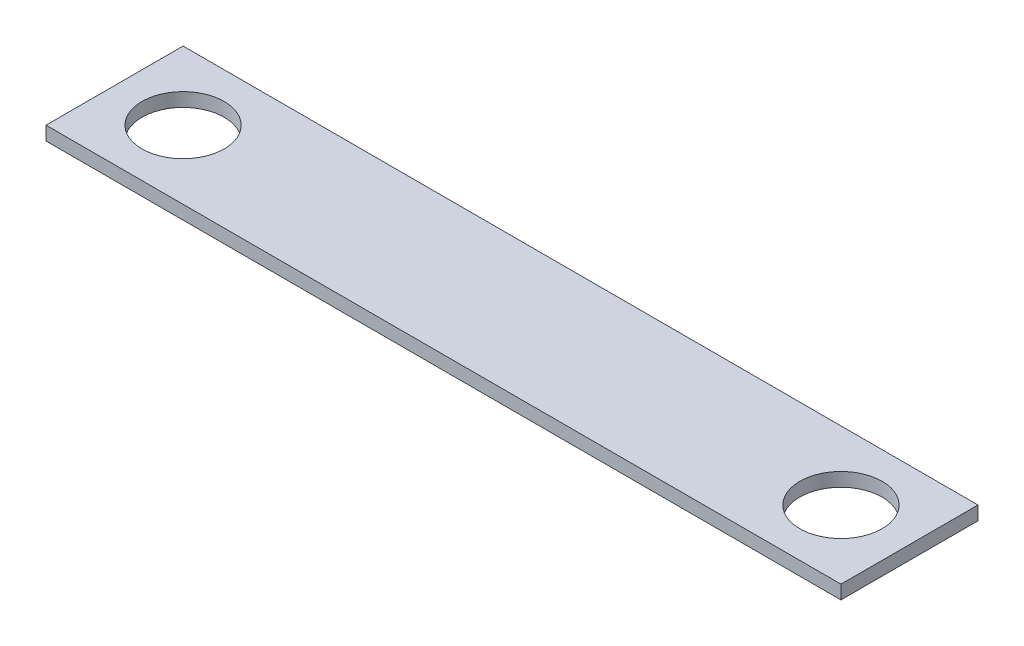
ISO-10303-21;
HEADER;
FILE_DESCRIPTION(('STEP AP214'),'2;1');
FILE_NAME('part.step','',(''),(''),'','','');
FILE_SCHEMA(('AUTOMOTIVE_DESIGN { 1 0 10303 214 1 1 1 1 }'));
ENDSEC;
DATA;
#1=APPLICATION_CONTEXT('core data for automotive mechanical design processes');
#2=APPLICATION_PROTOCOL_DEFINITION('international standard','automotive_design',2000,#1);
#3=PRODUCT_CONTEXT('',#1,'mechanical');
#4=PRODUCT('Part','Part','',(#3));
#5=PRODUCT_RELATED_PRODUCT_CATEGORY('part','',(#4));
#6=PRODUCT_DEFINITION_FORMATION('','',#4);
#7=PRODUCT_DEFINITION_CONTEXT('part definition',#1,'design');
#8=PRODUCT_DEFINITION('design','',#6,#7);
#9=PRODUCT_DEFINITION_SHAPE('','',#8);
#10=(LENGTH_UNIT() NAMED_UNIT(*) SI_UNIT(.MILLI.,.METRE.));
#11=(NAMED_UNIT(*) PLANE_ANGLE_UNIT() SI_UNIT($,.RADIAN.));
#12=(NAMED_UNIT(*) SI_UNIT($,.STERADIAN.) SOLID_ANGLE_UNIT());
#13=UNCERTAINTY_MEASURE_WITH_UNIT(LENGTH_MEASURE(1.E-05),#10,'distance_accuracy_value','');
#14=(GEOMETRIC_REPRESENTATION_CONTEXT(3) GLOBAL_UNCERTAINTY_ASSIGNED_CONTEXT((#13)) GLOBAL_UNIT_ASSIGNED_CONTEXT((#10,
#11,#12)) REPRESENTATION_CONTEXT('',''));
#15=CARTESIAN_POINT('',(0.,0.,0.));
#16=DIRECTION('',(0.,0.,1.));
#17=DIRECTION('',(1.,0.,0.));
#18=AXIS2_PLACEMENT_3D('',#15,#16,#17);
#19=CARTESIAN_POINT('',(0.,0.5,0.));
#20=DIRECTION('',(1.,0.,0.));
#21=DIRECTION('',(0.,0.,-1.));
#22=AXIS2_PLACEMENT_3D('',#19,#20,#21);
#23=PLANE('',#22);
#24=DIRECTION('',(0.,0.,1.));
#25=VECTOR('',#24,1.);
#26=CARTESIAN_POINT('',(0.,0.,0.));
#27=LINE('',#26,#25);
#28=CARTESIAN_POINT('',(0.,0.,-5.));
#29=VERTEX_POINT('',#28);
#30=CARTESIAN_POINT('',(0.,0.,0.));
#31=VERTEX_POINT('',#30);
#32=EDGE_CURVE('E97',#29,#31,#27,.T.);
#33=ORIENTED_EDGE('',*,*,#32,.T.);
#34=DIRECTION('',(0.,-1.,0.));
#35=VECTOR('',#34,1.);
#36=CARTESIAN_POINT('',(0.,0.5,0.));
#37=LINE('',#36,#35);
#38=CARTESIAN_POINT('',(0.,0.5,0.));
#39=VERTEX_POINT('',#38);
#40=EDGE_CURVE('E11',#39,#31,#37,.T.);
#41=ORIENTED_EDGE('',*,*,#40,.F.);
#42=DIRECTION('',(0.,0.,1.));
#43=VECTOR('',#42,1.);
#44=CARTESIAN_POINT('',(0.,0.5,0.));
#45=LINE('',#44,#43);
#46=CARTESIAN_POINT('',(0.,0.5,-5.));
#47=VERTEX_POINT('',#46);
#48=EDGE_CURVE('E85',#47,#39,#45,.T.);
#49=ORIENTED_EDGE('',*,*,#48,.F.);
#50=DIRECTION('',(0.,-1.,0.));
#51=VECTOR('',#50,1.);
#52=CARTESIAN_POINT('',(0.,0.5,-5.));
#53=LINE('',#52,#51);
#54=EDGE_CURVE('E93',#47,#29,#53,.T.);
#55=ORIENTED_EDGE('',*,*,#54,.T.);
#56=EDGE_LOOP('',(#33,#41,#49,#55));
#57=FACE_BOUND('',#56,.T.);
#58=ADVANCED_FACE('F34',(#57),#23,.F.);
#59=CARTESIAN_POINT('',(0.,0.5,0.));
#60=DIRECTION('',(0.,0.,-1.));
#61=DIRECTION('',(-1.,0.,0.));
#62=AXIS2_PLACEMENT_3D('',#59,#60,#61);
#63=PLANE('',#62);
#64=DIRECTION('',(1.,0.,0.));
#65=VECTOR('',#64,1.);
#66=CARTESIAN_POINT('',(0.,0.,0.));
#67=LINE('',#66,#65);
#68=CARTESIAN_POINT('',(29.,0.,0.));
#69=VERTEX_POINT('',#68);
#70=EDGE_CURVE('E89',#31,#69,#67,.T.);
#71=ORIENTED_EDGE('',*,*,#70,.T.);
#72=DIRECTION('',(0.,-1.,0.));
#73=VECTOR('',#72,1.);
#74=CARTESIAN_POINT('',(29.,0.5,0.));
#75=LINE('',#74,#73);
#76=CARTESIAN_POINT('',(29.,0.5,0.));
#77=VERTEX_POINT('',#76);
#78=EDGE_CURVE('E42',#77,#69,#75,.T.);
#79=ORIENTED_EDGE('',*,*,#78,.F.);
#80=DIRECTION('',(1.,0.,0.));
#81=VECTOR('',#80,1.);
#82=CARTESIAN_POINT('',(0.,0.5,0.));
#83=LINE('',#82,#81);
#84=EDGE_CURVE('E80',#39,#77,#83,.T.);
#85=ORIENTED_EDGE('',*,*,#84,.F.);
#86=ORIENTED_EDGE('',*,*,#40,.T.);
#87=EDGE_LOOP('',(#71,#79,#85,#86));
#88=FACE_BOUND('',#87,.T.);
#89=ADVANCED_FACE('F88',(#88),#63,.F.);
#90=CARTESIAN_POINT('',(29.,0.5,0.));
#91=DIRECTION('',(-1.,0.,0.));
#92=DIRECTION('',(0.,0.,1.));
#93=AXIS2_PLACEMENT_3D('',#90,#91,#92);
#94=PLANE('',#93);
#95=DIRECTION('',(0.,0.,-1.));
#96=VECTOR('',#95,1.);
#97=CARTESIAN_POINT('',(29.,0.,0.));
#98=LINE('',#97,#96);
#99=CARTESIAN_POINT('',(29.,0.,-5.));
#100=VERTEX_POINT('',#99);
#101=EDGE_CURVE('E67',#69,#100,#98,.T.);
#102=ORIENTED_EDGE('',*,*,#101,.T.);
#103=DIRECTION('',(0.,-1.,0.));
#104=VECTOR('',#103,1.);
#105=CARTESIAN_POINT('',(29.,0.5,-5.));
#106=LINE('',#105,#104);
#107=CARTESIAN_POINT('',(29.,0.5,-5.));
#108=VERTEX_POINT('',#107);
#109=EDGE_CURVE('E90',#108,#100,#106,.T.);
#110=ORIENTED_EDGE('',*,*,#109,.F.);
#111=DIRECTION('',(0.,0.,-1.));
#112=VECTOR('',#111,1.);
#113=CARTESIAN_POINT('',(29.,0.5,0.));
#114=LINE('',#113,#112);
#115=EDGE_CURVE('E83',#77,#108,#114,.T.);
#116=ORIENTED_EDGE('',*,*,#115,.F.);
#117=ORIENTED_EDGE('',*,*,#78,.T.);
#118=EDGE_LOOP('',(#102,#110,#116,#117));
#119=FACE_BOUND('',#118,.T.);
#120=ADVANCED_FACE('F91',(#119),#94,.F.);
#121=CARTESIAN_POINT('',(0.,0.5,-5.));
#122=DIRECTION('',(0.,0.,1.));
#123=DIRECTION('',(1.,0.,0.));
#124=AXIS2_PLACEMENT_3D('',#121,#122,#123);
#125=PLANE('',#124);
#126=DIRECTION('',(-1.,0.,0.));
#127=VECTOR('',#126,1.);
#128=CARTESIAN_POINT('',(0.,0.,-5.));
#129=LINE('',#128,#127);
#130=EDGE_CURVE('E73',#100,#29,#129,.T.);
#131=ORIENTED_EDGE('',*,*,#130,.T.);
#132=ORIENTED_EDGE('',*,*,#54,.F.);
#133=DIRECTION('',(-1.,0.,0.));
#134=VECTOR('',#133,1.);
#135=CARTESIAN_POINT('',(0.,0.5,-5.));
#136=LINE('',#135,#134);
#137=EDGE_CURVE('E50',#108,#47,#136,.T.);
#138=ORIENTED_EDGE('',*,*,#137,.F.);
#139=ORIENTED_EDGE('',*,*,#109,.T.);
#140=EDGE_LOOP('',(#131,#132,#138,#139));
#141=FACE_BOUND('',#140,.T.);
#142=ADVANCED_FACE('F105',(#141),#125,.F.);
#143=CARTESIAN_POINT('',(0.,0.5,-5.));
#144=DIRECTION('',(0.,-1.,0.));
#145=DIRECTION('',(0.,0.,-1.));
#146=AXIS2_PLACEMENT_3D('',#143,#144,#145);
#147=PLANE('',#146);
#148=CARTESIAN_POINT('',(26.5,0.5,-2.5));
#149=DIRECTION('',(0.,1.,0.));
#150=DIRECTION('',(0.,0.,-1.));
#151=AXIS2_PLACEMENT_3D('',#148,#149,#150);
#152=CIRCLE('',#151,1.5);
#153=CARTESIAN_POINT('',(26.5,0.5,-4.));
#154=VERTEX_POINT('',#153);
#155=EDGE_CURVE('E117',#154,#154,#152,.T.);
#156=ORIENTED_EDGE('',*,*,#155,.F.);
#157=EDGE_LOOP('',(#156));
#158=FACE_BOUND('',#157,.T.);
#159=CARTESIAN_POINT('',(2.5,0.5,-2.5));
#160=DIRECTION('',(0.,1.,0.));
#161=DIRECTION('',(0.,0.,1.));
#162=AXIS2_PLACEMENT_3D('',#159,#160,#161);
#163=CIRCLE('',#162,1.5);
#164=CARTESIAN_POINT('',(2.5,0.5,-1.));
#165=VERTEX_POINT('',#164);
#166=EDGE_CURVE('E111',#165,#165,#163,.T.);
#167=ORIENTED_EDGE('',*,*,#166,.F.);
#168=EDGE_LOOP('',(#167));
#169=FACE_BOUND('',#168,.T.);
#170=ORIENTED_EDGE('',*,*,#48,.T.);
#171=ORIENTED_EDGE('',*,*,#84,.T.);
#172=ORIENTED_EDGE('',*,*,#115,.T.);
#173=ORIENTED_EDGE('',*,*,#137,.T.);
#174=EDGE_LOOP('',(#170,#171,#172,#173));
#175=FACE_BOUND('',#174,.T.);
#176=ADVANCED_FACE('F81',(#158,#169,#175),#147,.F.);
#177=CARTESIAN_POINT('',(0.,0.,-5.));
#178=DIRECTION('',(0.,-1.,0.));
#179=DIRECTION('',(0.,0.,-1.));
#180=AXIS2_PLACEMENT_3D('',#177,#178,#179);
#181=PLANE('',#180);
#182=CARTESIAN_POINT('',(26.5,0.,-2.5));
#183=DIRECTION('',(0.,1.,0.));
#184=DIRECTION('',(0.,0.,-1.));
#185=AXIS2_PLACEMENT_3D('',#182,#183,#184);
#186=CIRCLE('',#185,1.5);
#187=CARTESIAN_POINT('',(26.5,0.,-4.));
#188=VERTEX_POINT('',#187);
#189=EDGE_CURVE('E114',#188,#188,#186,.T.);
#190=ORIENTED_EDGE('',*,*,#189,.T.);
#191=EDGE_LOOP('',(#190));
#192=FACE_BOUND('',#191,.T.);
#193=CARTESIAN_POINT('',(2.5,0.,-2.5));
#194=DIRECTION('',(0.,1.,0.));
#195=DIRECTION('',(0.,0.,1.));
#196=AXIS2_PLACEMENT_3D('',#193,#194,#195);
#197=CIRCLE('',#196,1.5);
#198=CARTESIAN_POINT('',(2.5,0.,-1.));
#199=VERTEX_POINT('',#198);
#200=EDGE_CURVE('E100',#199,#199,#197,.T.);
#201=ORIENTED_EDGE('',*,*,#200,.T.);
#202=EDGE_LOOP('',(#201));
#203=FACE_BOUND('',#202,.T.);
#204=ORIENTED_EDGE('',*,*,#32,.F.);
#205=ORIENTED_EDGE('',*,*,#130,.F.);
#206=ORIENTED_EDGE('',*,*,#101,.F.);
#207=ORIENTED_EDGE('',*,*,#70,.F.);
#208=EDGE_LOOP('',(#204,#205,#206,#207));
#209=FACE_BOUND('',#208,.T.);
#210=ADVANCED_FACE('F108',(#192,#203,#209),#181,.T.);
#211=CARTESIAN_POINT('',(2.5,0.,-2.5));
#212=DIRECTION('',(0.,1.,0.));
#213=DIRECTION('',(0.,0.,1.));
#214=AXIS2_PLACEMENT_3D('',#211,#212,#213);
#215=CYLINDRICAL_SURFACE('',#214,1.5);
#216=ORIENTED_EDGE('',*,*,#200,.F.);
#217=EDGE_LOOP('',(#216));
#218=FACE_BOUND('',#217,.T.);
#219=ORIENTED_EDGE('',*,*,#166,.T.);
#220=EDGE_LOOP('',(#219));
#221=FACE_BOUND('',#220,.T.);
#222=ADVANCED_FACE('F128',(#218,#221),#215,.F.);
#223=CARTESIAN_POINT('',(26.5,0.,-2.5));
#224=DIRECTION('',(0.,1.,0.));
#225=DIRECTION('',(0.,0.,1.));
#226=AXIS2_PLACEMENT_3D('',#223,#224,#225);
#227=CYLINDRICAL_SURFACE('',#226,1.5);
#228=ORIENTED_EDGE('',*,*,#189,.F.);
#229=EDGE_LOOP('',(#228));
#230=FACE_BOUND('',#229,.T.);
#231=ORIENTED_EDGE('',*,*,#155,.T.);
#232=EDGE_LOOP('',(#231));
#233=FACE_BOUND('',#232,.T.);
#234=ADVANCED_FACE('F125',(#230,#233),#227,.F.);
#235=CLOSED_SHELL('',(#58,#89,#120,#142,#176,#210,#222,#234));
#236=MANIFOLD_SOLID_BREP('B2',#235);
#237=ADVANCED_BREP_SHAPE_REPRESENTATION('',(#18,#236),#14);
#238=SHAPE_DEFINITION_REPRESENTATION(#9,#237);
ENDSEC;
END-ISO-10303-21;
